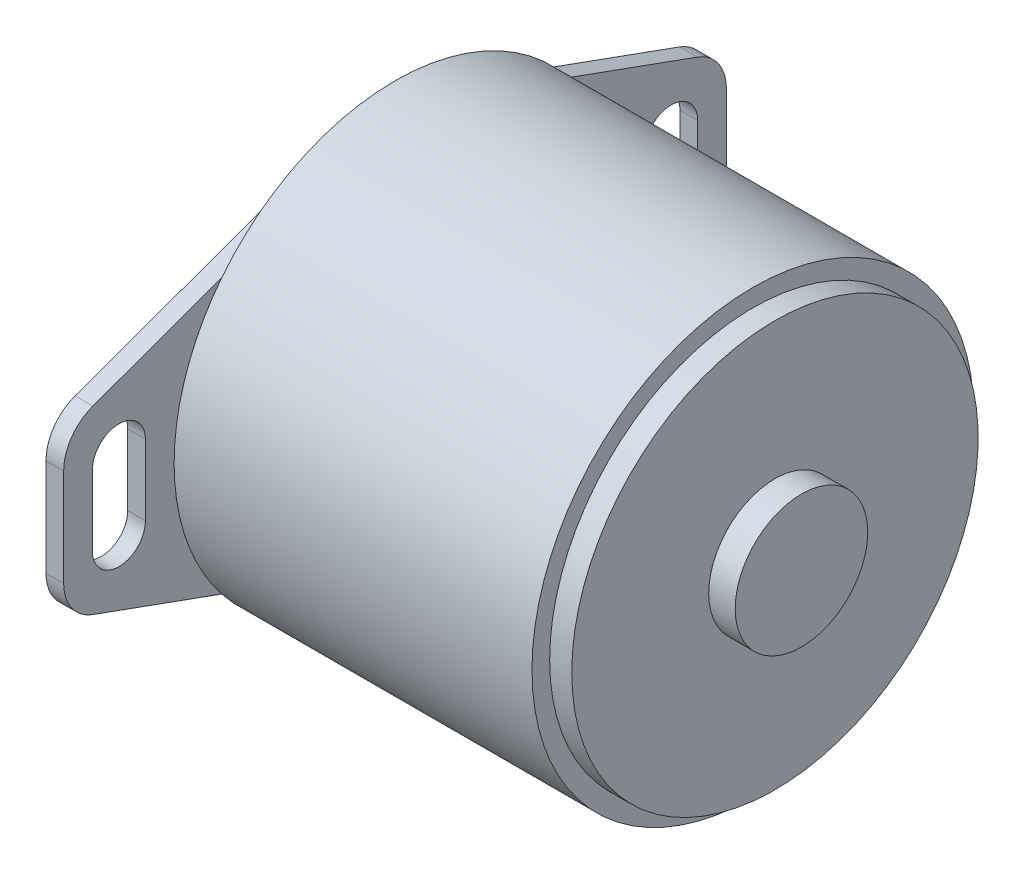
ISO-10303-21;
HEADER;
FILE_DESCRIPTION(('STEP AP214'),'2;1');
FILE_NAME('part.step','',(''),(''),'','','');
FILE_SCHEMA(('AUTOMOTIVE_DESIGN { 1 0 10303 214 1 1 1 1 }'));
ENDSEC;
DATA;
#1=APPLICATION_CONTEXT('core data for automotive mechanical design processes');
#2=APPLICATION_PROTOCOL_DEFINITION('international standard','automotive_design',2000,#1);
#3=PRODUCT_CONTEXT('',#1,'mechanical');
#4=PRODUCT('Part','Part','',(#3));
#5=PRODUCT_RELATED_PRODUCT_CATEGORY('part','',(#4));
#6=PRODUCT_DEFINITION_FORMATION('','',#4);
#7=PRODUCT_DEFINITION_CONTEXT('part definition',#1,'design');
#8=PRODUCT_DEFINITION('design','',#6,#7);
#9=PRODUCT_DEFINITION_SHAPE('','',#8);
#10=(LENGTH_UNIT() NAMED_UNIT(*) SI_UNIT(.MILLI.,.METRE.));
#11=(NAMED_UNIT(*) PLANE_ANGLE_UNIT() SI_UNIT($,.RADIAN.));
#12=(NAMED_UNIT(*) SI_UNIT($,.STERADIAN.) SOLID_ANGLE_UNIT());
#13=UNCERTAINTY_MEASURE_WITH_UNIT(LENGTH_MEASURE(1.E-05),#10,'distance_accuracy_value','');
#14=(GEOMETRIC_REPRESENTATION_CONTEXT(3) GLOBAL_UNCERTAINTY_ASSIGNED_CONTEXT((#13)) GLOBAL_UNIT_ASSIGNED_CONTEXT((#10,
#11,#12)) REPRESENTATION_CONTEXT('',''));
#15=CARTESIAN_POINT('',(0.,0.,0.));
#16=DIRECTION('',(0.,0.,1.));
#17=DIRECTION('',(1.,0.,0.));
#18=AXIS2_PLACEMENT_3D('',#15,#16,#17);
#19=CARTESIAN_POINT('',(6.2,3.,0.));
#20=DIRECTION('',(1.,0.,0.));
#21=DIRECTION('',(0.,0.,-1.));
#22=AXIS2_PLACEMENT_3D('',#19,#20,#21);
#23=PLANE('',#22);
#24=DIRECTION('',(0.,-0.340329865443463,0.940306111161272));
#25=VECTOR('',#24,1.);
#26=CARTESIAN_POINT('',(6.2,-4.08809734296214,-13.6806597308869));
#27=LINE('',#26,#25);
#28=CARTESIAN_POINT('',(6.2,-6.19980313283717,-7.84617366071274));
#29=VERTEX_POINT('',#28);
#30=CARTESIAN_POINT('',(6.2,-7.99260194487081,-2.89280385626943));
#31=VERTEX_POINT('',#30);
#32=EDGE_CURVE('E296',#29,#31,#27,.T.);
#33=ORIENTED_EDGE('',*,*,#32,.F.);
#34=CARTESIAN_POINT('',(6.2,0.,0.));
#35=DIRECTION('',(-1.,0.,0.));
#36=DIRECTION('',(0.,0.,1.));
#37=AXIS2_PLACEMENT_3D('',#34,#35,#36);
#38=CIRCLE('',#37,10.);
#39=CARTESIAN_POINT('',(6.2,-6.19980313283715,7.84617366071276));
#40=VERTEX_POINT('',#39);
#41=EDGE_CURVE('E543',#29,#40,#38,.T.);
#42=ORIENTED_EDGE('',*,*,#41,.T.);
#43=DIRECTION('',(0.,0.340329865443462,0.940306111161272));
#44=VECTOR('',#43,1.);
#45=CARTESIAN_POINT('',(6.2,-4.08809734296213,13.6806597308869));
#46=LINE('',#45,#44);
#47=CARTESIAN_POINT('',(6.2,-7.9926019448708,2.89280385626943));
#48=VERTEX_POINT('',#47);
#49=EDGE_CURVE('E52',#48,#40,#46,.T.);
#50=ORIENTED_EDGE('',*,*,#49,.F.);
#51=CARTESIAN_POINT('',(6.2,0.,0.));
#52=DIRECTION('',(-1.,0.,0.));
#53=DIRECTION('',(0.,0.,1.));
#54=AXIS2_PLACEMENT_3D('',#51,#52,#53);
#55=CIRCLE('',#54,8.49999999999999);
#56=EDGE_CURVE('E47',#31,#48,#55,.T.);
#57=ORIENTED_EDGE('',*,*,#56,.F.);
#58=EDGE_LOOP('',(#33,#42,#50,#57));
#59=FACE_BOUND('',#58,.T.);
#60=ADVANCED_FACE('F32',(#59),#23,.F.);
#61=DIRECTION('',(0.,-0.340329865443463,-0.940306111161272));
#62=VECTOR('',#61,1.);
#63=CARTESIAN_POINT('',(6.2,7.99260194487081,-2.89280385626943));
#64=LINE('',#63,#62);
#65=CARTESIAN_POINT('',(6.2,7.99260194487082,-2.89280385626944));
#66=VERTEX_POINT('',#65);
#67=CARTESIAN_POINT('',(6.2,6.19980313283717,-7.84617366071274));
#68=VERTEX_POINT('',#67);
#69=EDGE_CURVE('E287',#66,#68,#64,.T.);
#70=ORIENTED_EDGE('',*,*,#69,.F.);
#71=CARTESIAN_POINT('',(6.2,0.,0.));
#72=DIRECTION('',(-1.,0.,0.));
#73=DIRECTION('',(0.,0.,1.));
#74=AXIS2_PLACEMENT_3D('',#71,#72,#73);
#75=CIRCLE('',#74,8.5);
#76=CARTESIAN_POINT('',(6.2,7.99260194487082,2.89280385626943));
#77=VERTEX_POINT('',#76);
#78=EDGE_CURVE('E256',#77,#66,#75,.T.);
#79=ORIENTED_EDGE('',*,*,#78,.F.);
#80=DIRECTION('',(0.,0.340329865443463,-0.940306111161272));
#81=VECTOR('',#80,1.);
#82=CARTESIAN_POINT('',(6.2,7.99260194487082,2.89280385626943));
#83=LINE('',#82,#81);
#84=CARTESIAN_POINT('',(6.2,6.19980313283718,7.84617366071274));
#85=VERTEX_POINT('',#84);
#86=EDGE_CURVE('E309',#85,#77,#83,.T.);
#87=ORIENTED_EDGE('',*,*,#86,.F.);
#88=EDGE_CURVE('E363',#85,#68,#38,.T.);
#89=ORIENTED_EDGE('',*,*,#88,.T.);
#90=EDGE_LOOP('',(#70,#79,#87,#89));
#91=FACE_BOUND('',#90,.T.);
#92=ADVANCED_FACE('F393',(#91),#23,.F.);
#93=CARTESIAN_POINT('',(-32.441525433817,0.,0.));
#94=DIRECTION('',(-1.,0.,0.));
#95=DIRECTION('',(0.,0.,1.));
#96=AXIS2_PLACEMENT_3D('',#93,#94,#95);
#97=CYLINDRICAL_SURFACE('',#96,10.);
#98=ORIENTED_EDGE('',*,*,#88,.F.);
#99=EDGE_CURVE('E362',#40,#85,#38,.T.);
#100=ORIENTED_EDGE('',*,*,#99,.F.);
#101=ORIENTED_EDGE('',*,*,#41,.F.);
#102=EDGE_CURVE('E367',#68,#29,#38,.T.);
#103=ORIENTED_EDGE('',*,*,#102,.F.);
#104=EDGE_LOOP('',(#98,#100,#101,#103));
#105=FACE_BOUND('',#104,.T.);
#106=CARTESIAN_POINT('',(22.4,0.,0.));
#107=DIRECTION('',(-1.,0.,0.));
#108=DIRECTION('',(0.,0.,1.));
#109=AXIS2_PLACEMENT_3D('',#106,#107,#108);
#110=CIRCLE('',#109,10.);
#111=CARTESIAN_POINT('',(22.4,0.,10.));
#112=VERTEX_POINT('',#111);
#113=EDGE_CURVE('E359',#112,#112,#110,.T.);
#114=ORIENTED_EDGE('',*,*,#113,.T.);
#115=EDGE_LOOP('',(#114));
#116=FACE_BOUND('',#115,.T.);
#117=ADVANCED_FACE('F422',(#105,#116),#97,.T.);
#118=CARTESIAN_POINT('',(22.4,10.,0.));
#119=DIRECTION('',(-1.,0.,0.));
#120=DIRECTION('',(0.,0.,1.));
#121=AXIS2_PLACEMENT_3D('',#118,#119,#120);
#122=PLANE('',#121);
#123=ORIENTED_EDGE('',*,*,#113,.F.);
#124=EDGE_LOOP('',(#123));
#125=FACE_BOUND('',#124,.T.);
#126=CARTESIAN_POINT('',(22.4,0.,0.));
#127=DIRECTION('',(-1.,0.,0.));
#128=DIRECTION('',(0.,0.,1.));
#129=AXIS2_PLACEMENT_3D('',#126,#127,#128);
#130=CIRCLE('',#129,9.2);
#131=CARTESIAN_POINT('',(22.4,0.,9.2));
#132=VERTEX_POINT('',#131);
#133=EDGE_CURVE('E356',#132,#132,#130,.T.);
#134=ORIENTED_EDGE('',*,*,#133,.T.);
#135=EDGE_LOOP('',(#134));
#136=FACE_BOUND('',#135,.T.);
#137=ADVANCED_FACE('F547',(#125,#136),#122,.F.);
#138=CARTESIAN_POINT('',(-32.441525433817,0.,0.));
#139=DIRECTION('',(-1.,0.,0.));
#140=DIRECTION('',(0.,0.,1.));
#141=AXIS2_PLACEMENT_3D('',#138,#139,#140);
#142=CYLINDRICAL_SURFACE('',#141,9.2);
#143=ORIENTED_EDGE('',*,*,#133,.F.);
#144=EDGE_LOOP('',(#143));
#145=FACE_BOUND('',#144,.T.);
#146=CARTESIAN_POINT('',(23.4,0.,0.));
#147=DIRECTION('',(-1.,0.,0.));
#148=DIRECTION('',(0.,0.,1.));
#149=AXIS2_PLACEMENT_3D('',#146,#147,#148);
#150=CIRCLE('',#149,9.2);
#151=CARTESIAN_POINT('',(23.4,0.,9.2));
#152=VERTEX_POINT('',#151);
#153=EDGE_CURVE('E353',#152,#152,#150,.T.);
#154=ORIENTED_EDGE('',*,*,#153,.T.);
#155=EDGE_LOOP('',(#154));
#156=FACE_BOUND('',#155,.T.);
#157=ADVANCED_FACE('F552',(#145,#156),#142,.T.);
#158=CARTESIAN_POINT('',(23.4,9.2,0.));
#159=DIRECTION('',(-1.,0.,0.));
#160=DIRECTION('',(0.,0.,1.));
#161=AXIS2_PLACEMENT_3D('',#158,#159,#160);
#162=PLANE('',#161);
#163=ORIENTED_EDGE('',*,*,#153,.F.);
#164=EDGE_LOOP('',(#163));
#165=FACE_BOUND('',#164,.T.);
#166=CARTESIAN_POINT('',(23.4,0.,0.));
#167=DIRECTION('',(-1.,0.,0.));
#168=DIRECTION('',(0.,0.,1.));
#169=AXIS2_PLACEMENT_3D('',#166,#167,#168);
#170=CIRCLE('',#169,3.);
#171=CARTESIAN_POINT('',(23.4,0.,3.));
#172=VERTEX_POINT('',#171);
#173=EDGE_CURVE('E350',#172,#172,#170,.T.);
#174=ORIENTED_EDGE('',*,*,#173,.T.);
#175=EDGE_LOOP('',(#174));
#176=FACE_BOUND('',#175,.T.);
#177=ADVANCED_FACE('F557',(#165,#176),#162,.F.);
#178=CARTESIAN_POINT('',(-32.441525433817,0.,0.));
#179=DIRECTION('',(-1.,0.,0.));
#180=DIRECTION('',(0.,0.,1.));
#181=AXIS2_PLACEMENT_3D('',#178,#179,#180);
#182=CYLINDRICAL_SURFACE('',#181,3.);
#183=ORIENTED_EDGE('',*,*,#173,.F.);
#184=EDGE_LOOP('',(#183));
#185=FACE_BOUND('',#184,.T.);
#186=CARTESIAN_POINT('',(24.6,0.,0.));
#187=DIRECTION('',(-1.,0.,0.));
#188=DIRECTION('',(0.,0.,1.));
#189=AXIS2_PLACEMENT_3D('',#186,#187,#188);
#190=CIRCLE('',#189,3.);
#191=CARTESIAN_POINT('',(24.6,0.,3.));
#192=VERTEX_POINT('',#191);
#193=EDGE_CURVE('E347',#192,#192,#190,.T.);
#194=ORIENTED_EDGE('',*,*,#193,.T.);
#195=EDGE_LOOP('',(#194));
#196=FACE_BOUND('',#195,.T.);
#197=ADVANCED_FACE('F563',(#185,#196),#182,.T.);
#198=CARTESIAN_POINT('',(24.6,3.,0.));
#199=DIRECTION('',(-1.,0.,0.));
#200=DIRECTION('',(0.,0.,1.));
#201=AXIS2_PLACEMENT_3D('',#198,#199,#200);
#202=PLANE('',#201);
#203=ORIENTED_EDGE('',*,*,#193,.F.);
#204=EDGE_LOOP('',(#203));
#205=FACE_BOUND('',#204,.T.);
#206=ADVANCED_FACE('F415',(#205),#202,.F.);
#207=CARTESIAN_POINT('',(6.2,0.,0.));
#208=DIRECTION('',(-1.,0.,0.));
#209=DIRECTION('',(0.,0.,1.));
#210=AXIS2_PLACEMENT_3D('',#207,#208,#209);
#211=PLANE('',#210);
#212=CARTESIAN_POINT('',(6.2,1.6,-12.5));
#213=DIRECTION('',(-1.,0.,0.));
#214=DIRECTION('',(0.,0.,1.));
#215=AXIS2_PLACEMENT_3D('',#212,#213,#214);
#216=CIRCLE('',#215,1.2);
#217=CARTESIAN_POINT('',(6.2,1.6,-11.3));
#218=VERTEX_POINT('',#217);
#219=CARTESIAN_POINT('',(6.2,1.6,-13.7));
#220=VERTEX_POINT('',#219);
#221=EDGE_CURVE('E199',#218,#220,#216,.T.);
#222=ORIENTED_EDGE('',*,*,#221,.T.);
#223=DIRECTION('',(0.,-1.,0.));
#224=VECTOR('',#223,1.);
#225=CARTESIAN_POINT('',(6.2,1.6,-13.7));
#226=LINE('',#225,#224);
#227=CARTESIAN_POINT('',(6.2,-1.6,-13.7));
#228=VERTEX_POINT('',#227);
#229=EDGE_CURVE('E239',#220,#228,#226,.T.);
#230=ORIENTED_EDGE('',*,*,#229,.T.);
#231=CARTESIAN_POINT('',(6.2,-1.6,-12.5));
#232=DIRECTION('',(-1.,0.,0.));
#233=DIRECTION('',(0.,0.,1.));
#234=AXIS2_PLACEMENT_3D('',#231,#232,#233);
#235=CIRCLE('',#234,1.2);
#236=CARTESIAN_POINT('',(6.2,-1.6,-11.3));
#237=VERTEX_POINT('',#236);
#238=EDGE_CURVE('E242',#228,#237,#235,.T.);
#239=ORIENTED_EDGE('',*,*,#238,.T.);
#240=DIRECTION('',(0.,1.,0.));
#241=VECTOR('',#240,1.);
#242=CARTESIAN_POINT('',(6.2,1.6,-11.3));
#243=LINE('',#242,#241);
#244=EDGE_CURVE('E229',#237,#218,#243,.T.);
#245=ORIENTED_EDGE('',*,*,#244,.T.);
#246=EDGE_LOOP('',(#222,#230,#239,#245));
#247=FACE_BOUND('',#246,.T.);
#248=CARTESIAN_POINT('',(6.2,4.08809734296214,-13.6806597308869));
#249=VERTEX_POINT('',#248);
#250=EDGE_CURVE('E286',#68,#249,#64,.T.);
#251=ORIENTED_EDGE('',*,*,#250,.F.);
#252=ORIENTED_EDGE('',*,*,#102,.T.);
#253=CARTESIAN_POINT('',(6.2,-4.08809734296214,-13.6806597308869));
#254=VERTEX_POINT('',#253);
#255=EDGE_CURVE('E297',#254,#29,#27,.T.);
#256=ORIENTED_EDGE('',*,*,#255,.F.);
#257=CARTESIAN_POINT('',(6.2,-2.20748512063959,-13.));
#258=DIRECTION('',(-1.,0.,0.));
#259=DIRECTION('',(0.,0.,-1.));
#260=AXIS2_PLACEMENT_3D('',#257,#258,#259);
#261=CIRCLE('',#260,2.);
#262=CARTESIAN_POINT('',(6.2,-2.20748512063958,-15.));
#263=VERTEX_POINT('',#262);
#264=EDGE_CURVE('E294',#263,#254,#261,.T.);
#265=ORIENTED_EDGE('',*,*,#264,.F.);
#266=DIRECTION('',(0.,-1.,0.));
#267=VECTOR('',#266,1.);
#268=CARTESIAN_POINT('',(6.2,2.20748512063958,-15.));
#269=LINE('',#268,#267);
#270=CARTESIAN_POINT('',(6.2,2.20748512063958,-15.));
#271=VERTEX_POINT('',#270);
#272=EDGE_CURVE('E292',#271,#263,#269,.T.);
#273=ORIENTED_EDGE('',*,*,#272,.F.);
#274=CARTESIAN_POINT('',(6.2,2.20748512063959,-13.));
#275=DIRECTION('',(-1.,0.,0.));
#276=DIRECTION('',(0.,0.,1.));
#277=AXIS2_PLACEMENT_3D('',#274,#275,#276);
#278=CIRCLE('',#277,2.);
#279=EDGE_CURVE('E290',#249,#271,#278,.T.);
#280=ORIENTED_EDGE('',*,*,#279,.F.);
#281=EDGE_LOOP('',(#251,#252,#256,#265,#273,#280));
#282=FACE_BOUND('',#281,.T.);
#283=ADVANCED_FACE('F406',(#247,#282),#211,.F.);
#284=CARTESIAN_POINT('',(5.4,0.,0.));
#285=DIRECTION('',(-1.,0.,0.));
#286=DIRECTION('',(0.,0.,1.));
#287=AXIS2_PLACEMENT_3D('',#284,#285,#286);
#288=PLANE('',#287);
#289=DIRECTION('',(0.,-1.,0.));
#290=VECTOR('',#289,1.);
#291=CARTESIAN_POINT('',(5.4,1.60000000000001,11.3));
#292=LINE('',#291,#290);
#293=CARTESIAN_POINT('',(5.4,1.60000000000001,11.3));
#294=VERTEX_POINT('',#293);
#295=CARTESIAN_POINT('',(5.4,-1.59999999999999,11.3));
#296=VERTEX_POINT('',#295);
#297=EDGE_CURVE('E191',#294,#296,#292,.T.);
#298=ORIENTED_EDGE('',*,*,#297,.F.);
#299=CARTESIAN_POINT('',(5.4,1.60000000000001,12.5));
#300=DIRECTION('',(-1.,0.,0.));
#301=DIRECTION('',(0.,0.,-1.));
#302=AXIS2_PLACEMENT_3D('',#299,#300,#301);
#303=CIRCLE('',#302,1.2);
#304=CARTESIAN_POINT('',(5.4,1.60000000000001,13.7));
#305=VERTEX_POINT('',#304);
#306=EDGE_CURVE('E181',#305,#294,#303,.T.);
#307=ORIENTED_EDGE('',*,*,#306,.F.);
#308=DIRECTION('',(0.,1.,0.));
#309=VECTOR('',#308,1.);
#310=CARTESIAN_POINT('',(5.4,1.60000000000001,13.7));
#311=LINE('',#310,#309);
#312=CARTESIAN_POINT('',(5.4,-1.59999999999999,13.7));
#313=VERTEX_POINT('',#312);
#314=EDGE_CURVE('E208',#313,#305,#311,.T.);
#315=ORIENTED_EDGE('',*,*,#314,.F.);
#316=CARTESIAN_POINT('',(5.4,-1.59999999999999,12.5));
#317=DIRECTION('',(-1.,0.,0.));
#318=DIRECTION('',(0.,0.,-1.));
#319=AXIS2_PLACEMENT_3D('',#316,#317,#318);
#320=CIRCLE('',#319,1.2);
#321=EDGE_CURVE('E206',#296,#313,#320,.T.);
#322=ORIENTED_EDGE('',*,*,#321,.F.);
#323=EDGE_LOOP('',(#298,#307,#315,#322));
#324=FACE_BOUND('',#323,.T.);
#325=DIRECTION('',(0.,-1.,0.));
#326=VECTOR('',#325,1.);
#327=CARTESIAN_POINT('',(5.4,1.6,-13.7));
#328=LINE('',#327,#326);
#329=CARTESIAN_POINT('',(5.4,1.6,-13.7));
#330=VERTEX_POINT('',#329);
#331=CARTESIAN_POINT('',(5.4,-1.6,-13.7));
#332=VERTEX_POINT('',#331);
#333=EDGE_CURVE('E228',#330,#332,#328,.T.);
#334=ORIENTED_EDGE('',*,*,#333,.F.);
#335=CARTESIAN_POINT('',(5.4,1.6,-12.5));
#336=DIRECTION('',(-1.,0.,0.));
#337=DIRECTION('',(0.,0.,1.));
#338=AXIS2_PLACEMENT_3D('',#335,#336,#337);
#339=CIRCLE('',#338,1.2);
#340=CARTESIAN_POINT('',(5.4,1.6,-11.3));
#341=VERTEX_POINT('',#340);
#342=EDGE_CURVE('E226',#341,#330,#339,.T.);
#343=ORIENTED_EDGE('',*,*,#342,.F.);
#344=DIRECTION('',(0.,1.,0.));
#345=VECTOR('',#344,1.);
#346=CARTESIAN_POINT('',(5.4,1.6,-11.3));
#347=LINE('',#346,#345);
#348=CARTESIAN_POINT('',(5.4,-1.6,-11.3));
#349=VERTEX_POINT('',#348);
#350=EDGE_CURVE('E234',#349,#341,#347,.T.);
#351=ORIENTED_EDGE('',*,*,#350,.F.);
#352=CARTESIAN_POINT('',(5.4,-1.6,-12.5));
#353=DIRECTION('',(-1.,0.,0.));
#354=DIRECTION('',(0.,0.,1.));
#355=AXIS2_PLACEMENT_3D('',#352,#353,#354);
#356=CIRCLE('',#355,1.2);
#357=EDGE_CURVE('E231',#332,#349,#356,.T.);
#358=ORIENTED_EDGE('',*,*,#357,.F.);
#359=EDGE_LOOP('',(#334,#343,#351,#358));
#360=FACE_BOUND('',#359,.T.);
#361=CARTESIAN_POINT('',(5.4,0.,0.));
#362=DIRECTION('',(-1.,0.,0.));
#363=DIRECTION('',(0.,0.,1.));
#364=AXIS2_PLACEMENT_3D('',#361,#362,#363);
#365=CIRCLE('',#364,8.5);
#366=CARTESIAN_POINT('',(5.4,7.99260194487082,2.89280385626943));
#367=VERTEX_POINT('',#366);
#368=CARTESIAN_POINT('',(5.4,7.99260194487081,-2.89280385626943));
#369=VERTEX_POINT('',#368);
#370=EDGE_CURVE('E257',#367,#369,#365,.T.);
#371=ORIENTED_EDGE('',*,*,#370,.T.);
#372=DIRECTION('',(0.,-0.340329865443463,-0.940306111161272));
#373=VECTOR('',#372,1.);
#374=CARTESIAN_POINT('',(5.4,7.99260194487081,-2.89280385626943));
#375=LINE('',#374,#373);
#376=CARTESIAN_POINT('',(5.4,4.08809734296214,-13.6806597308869));
#377=VERTEX_POINT('',#376);
#378=EDGE_CURVE('E260',#369,#377,#375,.T.);
#379=ORIENTED_EDGE('',*,*,#378,.T.);
#380=CARTESIAN_POINT('',(5.4,2.20748512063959,-13.));
#381=DIRECTION('',(-1.,0.,0.));
#382=DIRECTION('',(0.,0.,1.));
#383=AXIS2_PLACEMENT_3D('',#380,#381,#382);
#384=CIRCLE('',#383,2.);
#385=CARTESIAN_POINT('',(5.4,2.20748512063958,-15.));
#386=VERTEX_POINT('',#385);
#387=EDGE_CURVE('E263',#377,#386,#384,.T.);
#388=ORIENTED_EDGE('',*,*,#387,.T.);
#389=DIRECTION('',(0.,-1.,0.));
#390=VECTOR('',#389,1.);
#391=CARTESIAN_POINT('',(5.4,2.20748512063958,-15.));
#392=LINE('',#391,#390);
#393=CARTESIAN_POINT('',(5.4,-2.20748512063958,-15.));
#394=VERTEX_POINT('',#393);
#395=EDGE_CURVE('E265',#386,#394,#392,.T.);
#396=ORIENTED_EDGE('',*,*,#395,.T.);
#397=CARTESIAN_POINT('',(5.4,-2.20748512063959,-13.));
#398=DIRECTION('',(-1.,0.,0.));
#399=DIRECTION('',(0.,0.,-1.));
#400=AXIS2_PLACEMENT_3D('',#397,#398,#399);
#401=CIRCLE('',#400,2.);
#402=CARTESIAN_POINT('',(5.4,-4.08809734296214,-13.6806597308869));
#403=VERTEX_POINT('',#402);
#404=EDGE_CURVE('E267',#394,#403,#401,.T.);
#405=ORIENTED_EDGE('',*,*,#404,.T.);
#406=DIRECTION('',(0.,-0.340329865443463,0.940306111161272));
#407=VECTOR('',#406,1.);
#408=CARTESIAN_POINT('',(5.4,-4.08809734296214,-13.6806597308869));
#409=LINE('',#408,#407);
#410=CARTESIAN_POINT('',(5.4,-7.99260194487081,-2.89280385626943));
#411=VERTEX_POINT('',#410);
#412=EDGE_CURVE('E269',#403,#411,#409,.T.);
#413=ORIENTED_EDGE('',*,*,#412,.T.);
#414=CARTESIAN_POINT('',(5.4,0.,0.));
#415=DIRECTION('',(-1.,0.,0.));
#416=DIRECTION('',(0.,0.,1.));
#417=AXIS2_PLACEMENT_3D('',#414,#415,#416);
#418=CIRCLE('',#417,8.49999999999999);
#419=CARTESIAN_POINT('',(5.4,-7.99260194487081,2.89280385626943));
#420=VERTEX_POINT('',#419);
#421=EDGE_CURVE('E271',#411,#420,#418,.T.);
#422=ORIENTED_EDGE('',*,*,#421,.T.);
#423=DIRECTION('',(0.,0.340329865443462,0.940306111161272));
#424=VECTOR('',#423,1.);
#425=CARTESIAN_POINT('',(5.4,-4.08809734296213,13.6806597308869));
#426=LINE('',#425,#424);
#427=CARTESIAN_POINT('',(5.4,-4.08809734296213,13.6806597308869));
#428=VERTEX_POINT('',#427);
#429=EDGE_CURVE('E273',#420,#428,#426,.T.);
#430=ORIENTED_EDGE('',*,*,#429,.T.);
#431=CARTESIAN_POINT('',(5.4,-2.20748512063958,13.));
#432=DIRECTION('',(-1.,0.,0.));
#433=DIRECTION('',(0.,0.,-1.));
#434=AXIS2_PLACEMENT_3D('',#431,#432,#433);
#435=CIRCLE('',#434,2.);
#436=CARTESIAN_POINT('',(5.4,-2.20748512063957,15.));
#437=VERTEX_POINT('',#436);
#438=EDGE_CURVE('E275',#428,#437,#435,.T.);
#439=ORIENTED_EDGE('',*,*,#438,.T.);
#440=DIRECTION('',(0.,1.,0.));
#441=VECTOR('',#440,1.);
#442=CARTESIAN_POINT('',(5.4,2.20748512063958,15.));
#443=LINE('',#442,#441);
#444=CARTESIAN_POINT('',(5.4,2.20748512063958,15.));
#445=VERTEX_POINT('',#444);
#446=EDGE_CURVE('E277',#437,#445,#443,.T.);
#447=ORIENTED_EDGE('',*,*,#446,.T.);
#448=CARTESIAN_POINT('',(5.4,2.20748512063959,13.));
#449=DIRECTION('',(-1.,0.,0.));
#450=DIRECTION('',(0.,0.,-1.));
#451=AXIS2_PLACEMENT_3D('',#448,#449,#450);
#452=CIRCLE('',#451,2.);
#453=CARTESIAN_POINT('',(5.4,4.08809734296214,13.6806597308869));
#454=VERTEX_POINT('',#453);
#455=EDGE_CURVE('E279',#445,#454,#452,.T.);
#456=ORIENTED_EDGE('',*,*,#455,.T.);
#457=DIRECTION('',(0.,0.340329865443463,-0.940306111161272));
#458=VECTOR('',#457,1.);
#459=CARTESIAN_POINT('',(5.4,7.99260194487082,2.89280385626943));
#460=LINE('',#459,#458);
#461=EDGE_CURVE('E281',#454,#367,#460,.T.);
#462=ORIENTED_EDGE('',*,*,#461,.T.);
#463=EDGE_LOOP('',(#371,#379,#388,#396,#405,#413,#422,#430,#439,#447,#456,#462));
#464=FACE_BOUND('',#463,.T.);
#465=CARTESIAN_POINT('',(5.4,0.,0.));
#466=DIRECTION('',(-1.,0.,0.));
#467=DIRECTION('',(0.,0.,1.));
#468=AXIS2_PLACEMENT_3D('',#465,#466,#467);
#469=CIRCLE('',#468,4.12883072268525);
#470=CARTESIAN_POINT('',(5.4,0.,4.12883072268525));
#471=VERTEX_POINT('',#470);
#472=EDGE_CURVE('E215',#471,#471,#469,.T.);
#473=ORIENTED_EDGE('',*,*,#472,.F.);
#474=EDGE_LOOP('',(#473));
#475=FACE_BOUND('',#474,.T.);
#476=ADVANCED_FACE('F203',(#324,#360,#464,#475),#288,.T.);
#477=CARTESIAN_POINT('',(6.2,-4.08809734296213,13.6806597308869));
#478=VERTEX_POINT('',#477);
#479=EDGE_CURVE('E301',#40,#478,#46,.T.);
#480=ORIENTED_EDGE('',*,*,#479,.F.);
#481=ORIENTED_EDGE('',*,*,#99,.T.);
#482=CARTESIAN_POINT('',(6.2,4.08809734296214,13.6806597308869));
#483=VERTEX_POINT('',#482);
#484=EDGE_CURVE('E261',#483,#85,#83,.T.);
#485=ORIENTED_EDGE('',*,*,#484,.F.);
#486=CARTESIAN_POINT('',(6.2,2.20748512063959,13.));
#487=DIRECTION('',(-1.,0.,0.));
#488=DIRECTION('',(0.,0.,-1.));
#489=AXIS2_PLACEMENT_3D('',#486,#487,#488);
#490=CIRCLE('',#489,2.);
#491=CARTESIAN_POINT('',(6.2,2.20748512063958,15.));
#492=VERTEX_POINT('',#491);
#493=EDGE_CURVE('E307',#492,#483,#490,.T.);
#494=ORIENTED_EDGE('',*,*,#493,.F.);
#495=DIRECTION('',(0.,1.,0.));
#496=VECTOR('',#495,1.);
#497=CARTESIAN_POINT('',(6.2,2.20748512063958,15.));
#498=LINE('',#497,#496);
#499=CARTESIAN_POINT('',(6.2,-2.20748512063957,15.));
#500=VERTEX_POINT('',#499);
#501=EDGE_CURVE('E305',#500,#492,#498,.T.);
#502=ORIENTED_EDGE('',*,*,#501,.F.);
#503=CARTESIAN_POINT('',(6.2,-2.20748512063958,13.));
#504=DIRECTION('',(-1.,0.,0.));
#505=DIRECTION('',(0.,0.,-1.));
#506=AXIS2_PLACEMENT_3D('',#503,#504,#505);
#507=CIRCLE('',#506,2.);
#508=EDGE_CURVE('E303',#478,#500,#507,.T.);
#509=ORIENTED_EDGE('',*,*,#508,.F.);
#510=EDGE_LOOP('',(#480,#481,#485,#494,#502,#509));
#511=FACE_BOUND('',#510,.T.);
#512=CARTESIAN_POINT('',(6.2,1.60000000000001,12.5));
#513=DIRECTION('',(-1.,0.,0.));
#514=DIRECTION('',(0.,0.,-1.));
#515=AXIS2_PLACEMENT_3D('',#512,#513,#514);
#516=CIRCLE('',#515,1.2);
#517=CARTESIAN_POINT('',(6.2,1.60000000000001,13.7));
#518=VERTEX_POINT('',#517);
#519=CARTESIAN_POINT('',(6.2,1.60000000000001,11.3));
#520=VERTEX_POINT('',#519);
#521=EDGE_CURVE('E213',#518,#520,#516,.T.);
#522=ORIENTED_EDGE('',*,*,#521,.T.);
#523=DIRECTION('',(0.,-1.,0.));
#524=VECTOR('',#523,1.);
#525=CARTESIAN_POINT('',(6.2,1.60000000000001,11.3));
#526=LINE('',#525,#524);
#527=CARTESIAN_POINT('',(6.2,-1.59999999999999,11.3));
#528=VERTEX_POINT('',#527);
#529=EDGE_CURVE('E198',#520,#528,#526,.T.);
#530=ORIENTED_EDGE('',*,*,#529,.T.);
#531=CARTESIAN_POINT('',(6.2,-1.59999999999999,12.5));
#532=DIRECTION('',(-1.,0.,0.));
#533=DIRECTION('',(0.,0.,-1.));
#534=AXIS2_PLACEMENT_3D('',#531,#532,#533);
#535=CIRCLE('',#534,1.2);
#536=CARTESIAN_POINT('',(6.2,-1.59999999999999,13.7));
#537=VERTEX_POINT('',#536);
#538=EDGE_CURVE('E217',#528,#537,#535,.T.);
#539=ORIENTED_EDGE('',*,*,#538,.T.);
#540=DIRECTION('',(0.,1.,0.));
#541=VECTOR('',#540,1.);
#542=CARTESIAN_POINT('',(6.2,1.60000000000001,13.7));
#543=LINE('',#542,#541);
#544=EDGE_CURVE('E192',#537,#518,#543,.T.);
#545=ORIENTED_EDGE('',*,*,#544,.T.);
#546=EDGE_LOOP('',(#522,#530,#539,#545));
#547=FACE_BOUND('',#546,.T.);
#548=ADVANCED_FACE('F405',(#511,#547),#211,.F.);
#549=CARTESIAN_POINT('',(5.4,0.,0.));
#550=DIRECTION('',(1.,0.,0.));
#551=DIRECTION('',(0.,0.,-1.));
#552=AXIS2_PLACEMENT_3D('',#549,#550,#551);
#553=CYLINDRICAL_SURFACE('',#552,8.5);
#554=ORIENTED_EDGE('',*,*,#78,.T.);
#555=DIRECTION('',(1.,0.,0.));
#556=VECTOR('',#555,1.);
#557=CARTESIAN_POINT('',(5.4,7.99260194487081,-2.89280385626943));
#558=LINE('',#557,#556);
#559=EDGE_CURVE('E344',#369,#66,#558,.T.);
#560=ORIENTED_EDGE('',*,*,#559,.F.);
#561=ORIENTED_EDGE('',*,*,#370,.F.);
#562=DIRECTION('',(1.,0.,0.));
#563=VECTOR('',#562,1.);
#564=CARTESIAN_POINT('',(5.4,7.99260194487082,2.89280385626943));
#565=LINE('',#564,#563);
#566=EDGE_CURVE('E283',#367,#77,#565,.T.);
#567=ORIENTED_EDGE('',*,*,#566,.T.);
#568=EDGE_LOOP('',(#554,#560,#561,#567));
#569=FACE_BOUND('',#568,.T.);
#570=ADVANCED_FACE('F412',(#569),#553,.T.);
#571=CARTESIAN_POINT('',(5.4,7.99260194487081,-2.89280385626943));
#572=DIRECTION('',(0.,-0.940306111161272,0.340329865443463));
#573=DIRECTION('',(0.,-0.340329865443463,-0.940306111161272));
#574=AXIS2_PLACEMENT_3D('',#571,#572,#573);
#575=PLANE('',#574);
#576=ORIENTED_EDGE('',*,*,#69,.T.);
#577=ORIENTED_EDGE('',*,*,#250,.T.);
#578=DIRECTION('',(1.,0.,0.));
#579=VECTOR('',#578,1.);
#580=CARTESIAN_POINT('',(5.4,4.08809734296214,-13.6806597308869));
#581=LINE('',#580,#579);
#582=EDGE_CURVE('E341',#377,#249,#581,.T.);
#583=ORIENTED_EDGE('',*,*,#582,.F.);
#584=ORIENTED_EDGE('',*,*,#378,.F.);
#585=ORIENTED_EDGE('',*,*,#559,.T.);
#586=EDGE_LOOP('',(#576,#577,#583,#584,#585));
#587=FACE_BOUND('',#586,.T.);
#588=ADVANCED_FACE('F491',(#587),#575,.F.);
#589=CARTESIAN_POINT('',(5.4,2.20748512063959,-13.));
#590=DIRECTION('',(1.,0.,0.));
#591=DIRECTION('',(0.,0.,-1.));
#592=AXIS2_PLACEMENT_3D('',#589,#590,#591);
#593=CYLINDRICAL_SURFACE('',#592,2.);
#594=ORIENTED_EDGE('',*,*,#279,.T.);
#595=DIRECTION('',(1.,0.,0.));
#596=VECTOR('',#595,1.);
#597=CARTESIAN_POINT('',(5.4,2.20748512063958,-15.));
#598=LINE('',#597,#596);
#599=EDGE_CURVE('E338',#386,#271,#598,.T.);
#600=ORIENTED_EDGE('',*,*,#599,.F.);
#601=ORIENTED_EDGE('',*,*,#387,.F.);
#602=ORIENTED_EDGE('',*,*,#582,.T.);
#603=EDGE_LOOP('',(#594,#600,#601,#602));
#604=FACE_BOUND('',#603,.T.);
#605=ADVANCED_FACE('F497',(#604),#593,.T.);
#606=CARTESIAN_POINT('',(5.4,2.20748512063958,-15.));
#607=DIRECTION('',(0.,0.,1.));
#608=DIRECTION('',(1.,0.,0.));
#609=AXIS2_PLACEMENT_3D('',#606,#607,#608);
#610=PLANE('',#609);
#611=ORIENTED_EDGE('',*,*,#272,.T.);
#612=DIRECTION('',(1.,0.,0.));
#613=VECTOR('',#612,1.);
#614=CARTESIAN_POINT('',(5.4,-2.20748512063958,-15.));
#615=LINE('',#614,#613);
#616=EDGE_CURVE('E335',#394,#263,#615,.T.);
#617=ORIENTED_EDGE('',*,*,#616,.F.);
#618=ORIENTED_EDGE('',*,*,#395,.F.);
#619=ORIENTED_EDGE('',*,*,#599,.T.);
#620=EDGE_LOOP('',(#611,#617,#618,#619));
#621=FACE_BOUND('',#620,.T.);
#622=ADVANCED_FACE('F503',(#621),#610,.F.);
#623=CARTESIAN_POINT('',(5.4,-2.20748512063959,-13.));
#624=DIRECTION('',(1.,0.,0.));
#625=DIRECTION('',(0.,0.,-1.));
#626=AXIS2_PLACEMENT_3D('',#623,#624,#625);
#627=CYLINDRICAL_SURFACE('',#626,2.);
#628=ORIENTED_EDGE('',*,*,#264,.T.);
#629=DIRECTION('',(1.,0.,0.));
#630=VECTOR('',#629,1.);
#631=CARTESIAN_POINT('',(5.4,-4.08809734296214,-13.6806597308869));
#632=LINE('',#631,#630);
#633=EDGE_CURVE('E332',#403,#254,#632,.T.);
#634=ORIENTED_EDGE('',*,*,#633,.F.);
#635=ORIENTED_EDGE('',*,*,#404,.F.);
#636=ORIENTED_EDGE('',*,*,#616,.T.);
#637=EDGE_LOOP('',(#628,#634,#635,#636));
#638=FACE_BOUND('',#637,.T.);
#639=ADVANCED_FACE('F507',(#638),#627,.T.);
#640=CARTESIAN_POINT('',(5.4,-4.08809734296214,-13.6806597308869));
#641=DIRECTION('',(0.,0.940306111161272,0.340329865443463));
#642=DIRECTION('',(0.,-0.340329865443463,0.940306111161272));
#643=AXIS2_PLACEMENT_3D('',#640,#641,#642);
#644=PLANE('',#643);
#645=ORIENTED_EDGE('',*,*,#255,.T.);
#646=ORIENTED_EDGE('',*,*,#32,.T.);
#647=DIRECTION('',(1.,0.,0.));
#648=VECTOR('',#647,1.);
#649=CARTESIAN_POINT('',(5.4,-7.99260194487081,-2.89280385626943));
#650=LINE('',#649,#648);
#651=EDGE_CURVE('E329',#411,#31,#650,.T.);
#652=ORIENTED_EDGE('',*,*,#651,.F.);
#653=ORIENTED_EDGE('',*,*,#412,.F.);
#654=ORIENTED_EDGE('',*,*,#633,.T.);
#655=EDGE_LOOP('',(#645,#646,#652,#653,#654));
#656=FACE_BOUND('',#655,.T.);
#657=ADVANCED_FACE('F512',(#656),#644,.F.);
#658=CARTESIAN_POINT('',(5.4,0.,0.));
#659=DIRECTION('',(1.,0.,0.));
#660=DIRECTION('',(0.,0.,-1.));
#661=AXIS2_PLACEMENT_3D('',#658,#659,#660);
#662=CYLINDRICAL_SURFACE('',#661,8.49999999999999);
#663=ORIENTED_EDGE('',*,*,#56,.T.);
#664=DIRECTION('',(1.,0.,0.));
#665=VECTOR('',#664,1.);
#666=CARTESIAN_POINT('',(5.4,-7.99260194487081,2.89280385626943));
#667=LINE('',#666,#665);
#668=EDGE_CURVE('E326',#420,#48,#667,.T.);
#669=ORIENTED_EDGE('',*,*,#668,.F.);
#670=ORIENTED_EDGE('',*,*,#421,.F.);
#671=ORIENTED_EDGE('',*,*,#651,.T.);
#672=EDGE_LOOP('',(#663,#669,#670,#671));
#673=FACE_BOUND('',#672,.T.);
#674=ADVANCED_FACE('F518',(#673),#662,.T.);
#675=CARTESIAN_POINT('',(5.4,-4.08809734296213,13.6806597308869));
#676=DIRECTION('',(0.,0.940306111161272,-0.340329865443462));
#677=DIRECTION('',(0.,0.340329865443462,0.940306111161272));
#678=AXIS2_PLACEMENT_3D('',#675,#676,#677);
#679=PLANE('',#678);
#680=ORIENTED_EDGE('',*,*,#49,.T.);
#681=ORIENTED_EDGE('',*,*,#479,.T.);
#682=DIRECTION('',(1.,0.,0.));
#683=VECTOR('',#682,1.);
#684=CARTESIAN_POINT('',(5.4,-4.08809734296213,13.6806597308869));
#685=LINE('',#684,#683);
#686=EDGE_CURVE('E323',#428,#478,#685,.T.);
#687=ORIENTED_EDGE('',*,*,#686,.F.);
#688=ORIENTED_EDGE('',*,*,#429,.F.);
#689=ORIENTED_EDGE('',*,*,#668,.T.);
#690=EDGE_LOOP('',(#680,#681,#687,#688,#689));
#691=FACE_BOUND('',#690,.T.);
#692=ADVANCED_FACE('F520',(#691),#679,.F.);
#693=CARTESIAN_POINT('',(5.4,-2.20748512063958,13.));
#694=DIRECTION('',(1.,0.,0.));
#695=DIRECTION('',(0.,0.,-1.));
#696=AXIS2_PLACEMENT_3D('',#693,#694,#695);
#697=CYLINDRICAL_SURFACE('',#696,2.);
#698=ORIENTED_EDGE('',*,*,#508,.T.);
#699=DIRECTION('',(1.,0.,0.));
#700=VECTOR('',#699,1.);
#701=CARTESIAN_POINT('',(5.4,-2.20748512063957,15.));
#702=LINE('',#701,#700);
#703=EDGE_CURVE('E320',#437,#500,#702,.T.);
#704=ORIENTED_EDGE('',*,*,#703,.F.);
#705=ORIENTED_EDGE('',*,*,#438,.F.);
#706=ORIENTED_EDGE('',*,*,#686,.T.);
#707=EDGE_LOOP('',(#698,#704,#705,#706));
#708=FACE_BOUND('',#707,.T.);
#709=ADVANCED_FACE('F526',(#708),#697,.T.);
#710=CARTESIAN_POINT('',(5.4,2.20748512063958,15.));
#711=DIRECTION('',(0.,0.,-1.));
#712=DIRECTION('',(-1.,0.,0.));
#713=AXIS2_PLACEMENT_3D('',#710,#711,#712);
#714=PLANE('',#713);
#715=ORIENTED_EDGE('',*,*,#501,.T.);
#716=DIRECTION('',(1.,0.,0.));
#717=VECTOR('',#716,1.);
#718=CARTESIAN_POINT('',(5.4,2.20748512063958,15.));
#719=LINE('',#718,#717);
#720=EDGE_CURVE('E317',#445,#492,#719,.T.);
#721=ORIENTED_EDGE('',*,*,#720,.F.);
#722=ORIENTED_EDGE('',*,*,#446,.F.);
#723=ORIENTED_EDGE('',*,*,#703,.T.);
#724=EDGE_LOOP('',(#715,#721,#722,#723));
#725=FACE_BOUND('',#724,.T.);
#726=ADVANCED_FACE('F532',(#725),#714,.F.);
#727=CARTESIAN_POINT('',(5.4,2.20748512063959,13.));
#728=DIRECTION('',(1.,0.,0.));
#729=DIRECTION('',(0.,0.,-1.));
#730=AXIS2_PLACEMENT_3D('',#727,#728,#729);
#731=CYLINDRICAL_SURFACE('',#730,2.);
#732=ORIENTED_EDGE('',*,*,#493,.T.);
#733=DIRECTION('',(1.,0.,0.));
#734=VECTOR('',#733,1.);
#735=CARTESIAN_POINT('',(5.4,4.08809734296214,13.6806597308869));
#736=LINE('',#735,#734);
#737=EDGE_CURVE('E314',#454,#483,#736,.T.);
#738=ORIENTED_EDGE('',*,*,#737,.F.);
#739=ORIENTED_EDGE('',*,*,#455,.F.);
#740=ORIENTED_EDGE('',*,*,#720,.T.);
#741=EDGE_LOOP('',(#732,#738,#739,#740));
#742=FACE_BOUND('',#741,.T.);
#743=ADVANCED_FACE('F470',(#742),#731,.T.);
#744=CARTESIAN_POINT('',(5.4,7.99260194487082,2.89280385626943));
#745=DIRECTION('',(0.,-0.940306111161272,-0.340329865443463));
#746=DIRECTION('',(0.,0.340329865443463,-0.940306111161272));
#747=AXIS2_PLACEMENT_3D('',#744,#745,#746);
#748=PLANE('',#747);
#749=ORIENTED_EDGE('',*,*,#484,.T.);
#750=ORIENTED_EDGE('',*,*,#86,.T.);
#751=ORIENTED_EDGE('',*,*,#566,.F.);
#752=ORIENTED_EDGE('',*,*,#461,.F.);
#753=ORIENTED_EDGE('',*,*,#737,.T.);
#754=EDGE_LOOP('',(#749,#750,#751,#752,#753));
#755=FACE_BOUND('',#754,.T.);
#756=ADVANCED_FACE('F465',(#755),#748,.F.);
#757=CARTESIAN_POINT('',(5.4,1.6,-12.5));
#758=DIRECTION('',(1.,0.,0.));
#759=DIRECTION('',(0.,0.,-1.));
#760=AXIS2_PLACEMENT_3D('',#757,#758,#759);
#761=CYLINDRICAL_SURFACE('',#760,1.2);
#762=ORIENTED_EDGE('',*,*,#221,.F.);
#763=DIRECTION('',(1.,0.,0.));
#764=VECTOR('',#763,1.);
#765=CARTESIAN_POINT('',(5.4,1.6,-11.3));
#766=LINE('',#765,#764);
#767=EDGE_CURVE('E236',#341,#218,#766,.T.);
#768=ORIENTED_EDGE('',*,*,#767,.F.);
#769=ORIENTED_EDGE('',*,*,#342,.T.);
#770=DIRECTION('',(1.,0.,0.));
#771=VECTOR('',#770,1.);
#772=CARTESIAN_POINT('',(5.4,1.6,-13.7));
#773=LINE('',#772,#771);
#774=EDGE_CURVE('E253',#330,#220,#773,.T.);
#775=ORIENTED_EDGE('',*,*,#774,.T.);
#776=EDGE_LOOP('',(#762,#768,#769,#775));
#777=FACE_BOUND('',#776,.T.);
#778=ADVANCED_FACE('F462',(#777),#761,.F.);
#779=CARTESIAN_POINT('',(5.4,1.6,-13.7));
#780=DIRECTION('',(0.,0.,1.));
#781=DIRECTION('',(1.,0.,0.));
#782=AXIS2_PLACEMENT_3D('',#779,#780,#781);
#783=PLANE('',#782);
#784=ORIENTED_EDGE('',*,*,#229,.F.);
#785=ORIENTED_EDGE('',*,*,#774,.F.);
#786=ORIENTED_EDGE('',*,*,#333,.T.);
#787=DIRECTION('',(1.,0.,0.));
#788=VECTOR('',#787,1.);
#789=CARTESIAN_POINT('',(5.4,-1.6,-13.7));
#790=LINE('',#789,#788);
#791=EDGE_CURVE('E251',#332,#228,#790,.T.);
#792=ORIENTED_EDGE('',*,*,#791,.T.);
#793=EDGE_LOOP('',(#784,#785,#786,#792));
#794=FACE_BOUND('',#793,.T.);
#795=ADVANCED_FACE('F459',(#794),#783,.T.);
#796=CARTESIAN_POINT('',(5.4,-1.6,-12.5));
#797=DIRECTION('',(1.,0.,0.));
#798=DIRECTION('',(0.,0.,-1.));
#799=AXIS2_PLACEMENT_3D('',#796,#797,#798);
#800=CYLINDRICAL_SURFACE('',#799,1.2);
#801=ORIENTED_EDGE('',*,*,#238,.F.);
#802=ORIENTED_EDGE('',*,*,#791,.F.);
#803=ORIENTED_EDGE('',*,*,#357,.T.);
#804=DIRECTION('',(1.,0.,0.));
#805=VECTOR('',#804,1.);
#806=CARTESIAN_POINT('',(5.4,-1.6,-11.3));
#807=LINE('',#806,#805);
#808=EDGE_CURVE('E249',#349,#237,#807,.T.);
#809=ORIENTED_EDGE('',*,*,#808,.T.);
#810=EDGE_LOOP('',(#801,#802,#803,#809));
#811=FACE_BOUND('',#810,.T.);
#812=ADVANCED_FACE('F455',(#811),#800,.F.);
#813=CARTESIAN_POINT('',(5.4,1.6,-11.3));
#814=DIRECTION('',(0.,0.,-1.));
#815=DIRECTION('',(-1.,0.,0.));
#816=AXIS2_PLACEMENT_3D('',#813,#814,#815);
#817=PLANE('',#816);
#818=ORIENTED_EDGE('',*,*,#244,.F.);
#819=ORIENTED_EDGE('',*,*,#808,.F.);
#820=ORIENTED_EDGE('',*,*,#350,.T.);
#821=ORIENTED_EDGE('',*,*,#767,.T.);
#822=EDGE_LOOP('',(#818,#819,#820,#821));
#823=FACE_BOUND('',#822,.T.);
#824=ADVANCED_FACE('F452',(#823),#817,.T.);
#825=CARTESIAN_POINT('',(5.4,1.60000000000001,12.5));
#826=DIRECTION('',(1.,0.,0.));
#827=DIRECTION('',(0.,0.,-1.));
#828=AXIS2_PLACEMENT_3D('',#825,#826,#827);
#829=CYLINDRICAL_SURFACE('',#828,1.2);
#830=ORIENTED_EDGE('',*,*,#521,.F.);
#831=DIRECTION('',(1.,0.,0.));
#832=VECTOR('',#831,1.);
#833=CARTESIAN_POINT('',(5.4,1.60000000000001,13.7));
#834=LINE('',#833,#832);
#835=EDGE_CURVE('E187',#305,#518,#834,.T.);
#836=ORIENTED_EDGE('',*,*,#835,.F.);
#837=ORIENTED_EDGE('',*,*,#306,.T.);
#838=DIRECTION('',(1.,0.,0.));
#839=VECTOR('',#838,1.);
#840=CARTESIAN_POINT('',(5.4,1.60000000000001,11.3));
#841=LINE('',#840,#839);
#842=EDGE_CURVE('E184',#294,#520,#841,.T.);
#843=ORIENTED_EDGE('',*,*,#842,.T.);
#844=EDGE_LOOP('',(#830,#836,#837,#843));
#845=FACE_BOUND('',#844,.T.);
#846=ADVANCED_FACE('F183',(#845),#829,.F.);
#847=CARTESIAN_POINT('',(5.4,1.60000000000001,11.3));
#848=DIRECTION('',(0.,0.,1.));
#849=DIRECTION('',(1.,0.,0.));
#850=AXIS2_PLACEMENT_3D('',#847,#848,#849);
#851=PLANE('',#850);
#852=ORIENTED_EDGE('',*,*,#529,.F.);
#853=ORIENTED_EDGE('',*,*,#842,.F.);
#854=ORIENTED_EDGE('',*,*,#297,.T.);
#855=DIRECTION('',(1.,0.,0.));
#856=VECTOR('',#855,1.);
#857=CARTESIAN_POINT('',(5.4,-1.59999999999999,11.3));
#858=LINE('',#857,#856);
#859=EDGE_CURVE('E200',#296,#528,#858,.T.);
#860=ORIENTED_EDGE('',*,*,#859,.T.);
#861=EDGE_LOOP('',(#852,#853,#854,#860));
#862=FACE_BOUND('',#861,.T.);
#863=ADVANCED_FACE('F195',(#862),#851,.T.);
#864=CARTESIAN_POINT('',(5.4,-1.59999999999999,12.5));
#865=DIRECTION('',(1.,0.,0.));
#866=DIRECTION('',(0.,0.,-1.));
#867=AXIS2_PLACEMENT_3D('',#864,#865,#866);
#868=CYLINDRICAL_SURFACE('',#867,1.2);
#869=ORIENTED_EDGE('',*,*,#538,.F.);
#870=ORIENTED_EDGE('',*,*,#859,.F.);
#871=ORIENTED_EDGE('',*,*,#321,.T.);
#872=DIRECTION('',(1.,0.,0.));
#873=VECTOR('',#872,1.);
#874=CARTESIAN_POINT('',(5.4,-1.59999999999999,13.7));
#875=LINE('',#874,#873);
#876=EDGE_CURVE('E223',#313,#537,#875,.T.);
#877=ORIENTED_EDGE('',*,*,#876,.T.);
#878=EDGE_LOOP('',(#869,#870,#871,#877));
#879=FACE_BOUND('',#878,.T.);
#880=ADVANCED_FACE('F441',(#879),#868,.F.);
#881=CARTESIAN_POINT('',(5.4,1.60000000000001,13.7));
#882=DIRECTION('',(0.,0.,-1.));
#883=DIRECTION('',(-1.,0.,0.));
#884=AXIS2_PLACEMENT_3D('',#881,#882,#883);
#885=PLANE('',#884);
#886=ORIENTED_EDGE('',*,*,#544,.F.);
#887=ORIENTED_EDGE('',*,*,#876,.F.);
#888=ORIENTED_EDGE('',*,*,#314,.T.);
#889=ORIENTED_EDGE('',*,*,#835,.T.);
#890=EDGE_LOOP('',(#886,#887,#888,#889));
#891=FACE_BOUND('',#890,.T.);
#892=ADVANCED_FACE('F436',(#891),#885,.T.);
#893=CARTESIAN_POINT('',(5.4,0.,0.));
#894=DIRECTION('',(1.,0.,0.));
#895=DIRECTION('',(0.,0.,-1.));
#896=AXIS2_PLACEMENT_3D('',#893,#894,#895);
#897=CYLINDRICAL_SURFACE('',#896,4.12883072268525);
#898=ORIENTED_EDGE('',*,*,#472,.T.);
#899=EDGE_LOOP('',(#898));
#900=FACE_BOUND('',#899,.T.);
#901=CARTESIAN_POINT('',(6.2,0.,0.));
#902=DIRECTION('',(-1.,0.,0.));
#903=DIRECTION('',(0.,0.,1.));
#904=AXIS2_PLACEMENT_3D('',#901,#902,#903);
#905=CIRCLE('',#904,4.12883072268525);
#906=CARTESIAN_POINT('',(6.2,0.,4.12883072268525));
#907=VERTEX_POINT('',#906);
#908=EDGE_CURVE('E396',#907,#907,#905,.T.);
#909=ORIENTED_EDGE('',*,*,#908,.F.);
#910=EDGE_LOOP('',(#909));
#911=FACE_BOUND('',#910,.T.);
#912=ADVANCED_FACE('F402',(#900,#911),#897,.F.);
#913=CARTESIAN_POINT('',(0.,0.,0.));
#914=DIRECTION('',(1.,0.,0.));
#915=DIRECTION('',(0.,0.,-1.));
#916=AXIS2_PLACEMENT_3D('',#913,#914,#915);
#917=PLANE('',#916);
#918=CARTESIAN_POINT('',(0.,0.,0.));
#919=DIRECTION('',(-1.,0.,0.));
#920=DIRECTION('',(0.,0.,1.));
#921=AXIS2_PLACEMENT_3D('',#918,#919,#920);
#922=CIRCLE('',#921,0.75);
#923=CARTESIAN_POINT('',(0.,0.,0.75));
#924=VERTEX_POINT('',#923);
#925=EDGE_CURVE('E11',#924,#924,#922,.T.);
#926=ORIENTED_EDGE('',*,*,#925,.T.);
#927=EDGE_LOOP('',(#926));
#928=FACE_BOUND('',#927,.T.);
#929=ADVANCED_FACE('F34',(#928),#917,.F.);
#930=CARTESIAN_POINT('',(-32.441525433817,0.,0.));
#931=DIRECTION('',(-1.,0.,0.));
#932=DIRECTION('',(0.,0.,1.));
#933=AXIS2_PLACEMENT_3D('',#930,#931,#932);
#934=CYLINDRICAL_SURFACE('',#933,0.75);
#935=ORIENTED_EDGE('',*,*,#925,.F.);
#936=EDGE_LOOP('',(#935));
#937=FACE_BOUND('',#936,.T.);
#938=CARTESIAN_POINT('',(4.2,0.,0.));
#939=DIRECTION('',(-1.,0.,0.));
#940=DIRECTION('',(0.,0.,1.));
#941=AXIS2_PLACEMENT_3D('',#938,#939,#940);
#942=CIRCLE('',#941,0.75);
#943=CARTESIAN_POINT('',(4.2,0.,0.75));
#944=VERTEX_POINT('',#943);
#945=EDGE_CURVE('E40',#944,#944,#942,.T.);
#946=ORIENTED_EDGE('',*,*,#945,.T.);
#947=EDGE_LOOP('',(#946));
#948=FACE_BOUND('',#947,.T.);
#949=ADVANCED_FACE('F375',(#937,#948),#934,.T.);
#950=CARTESIAN_POINT('',(4.2,0.75,0.));
#951=DIRECTION('',(1.,0.,0.));
#952=DIRECTION('',(0.,0.,-1.));
#953=AXIS2_PLACEMENT_3D('',#950,#951,#952);
#954=PLANE('',#953);
#955=ORIENTED_EDGE('',*,*,#945,.F.);
#956=EDGE_LOOP('',(#955));
#957=FACE_BOUND('',#956,.T.);
#958=CARTESIAN_POINT('',(4.2,0.,0.));
#959=DIRECTION('',(-1.,0.,0.));
#960=DIRECTION('',(0.,0.,1.));
#961=AXIS2_PLACEMENT_3D('',#958,#959,#960);
#962=CIRCLE('',#961,3.);
#963=CARTESIAN_POINT('',(4.2,0.,3.));
#964=VERTEX_POINT('',#963);
#965=EDGE_CURVE('E370',#964,#964,#962,.T.);
#966=ORIENTED_EDGE('',*,*,#965,.T.);
#967=EDGE_LOOP('',(#966));
#968=FACE_BOUND('',#967,.T.);
#969=ADVANCED_FACE('F377',(#957,#968),#954,.F.);
#970=CARTESIAN_POINT('',(-32.441525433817,0.,0.));
#971=DIRECTION('',(-1.,0.,0.));
#972=DIRECTION('',(0.,0.,1.));
#973=AXIS2_PLACEMENT_3D('',#970,#971,#972);
#974=CYLINDRICAL_SURFACE('',#973,3.);
#975=ORIENTED_EDGE('',*,*,#965,.F.);
#976=EDGE_LOOP('',(#975));
#977=FACE_BOUND('',#976,.T.);
#978=CARTESIAN_POINT('',(6.2,0.,0.));
#979=DIRECTION('',(-1.,0.,0.));
#980=DIRECTION('',(0.,0.,1.));
#981=AXIS2_PLACEMENT_3D('',#978,#979,#980);
#982=CIRCLE('',#981,3.);
#983=CARTESIAN_POINT('',(6.2,0.,3.));
#984=VERTEX_POINT('',#983);
#985=EDGE_CURVE('E366',#984,#984,#982,.T.);
#986=ORIENTED_EDGE('',*,*,#985,.T.);
#987=EDGE_LOOP('',(#986));
#988=FACE_BOUND('',#987,.T.);
#989=ADVANCED_FACE('F380',(#977,#988),#974,.T.);
#990=ORIENTED_EDGE('',*,*,#985,.F.);
#991=EDGE_LOOP('',(#990));
#992=FACE_BOUND('',#991,.T.);
#993=ORIENTED_EDGE('',*,*,#908,.T.);
#994=EDGE_LOOP('',(#993));
#995=FACE_BOUND('',#994,.T.);
#996=ADVANCED_FACE('F386',(#992,#995),#23,.F.);
#997=CLOSED_SHELL('',(#60,#92,#117,#137,#157,#177,#197,#206,#283,#476,#548,#570,#588,#605,#622,
#639,#657,#674,#692,#709,#726,#743,#756,#778,#795,#812,#824,#846,#863,#880,#892,#912,#929,#949,
#969,#989,#996));
#998=MANIFOLD_SOLID_BREP('B2',#997);
#999=ADVANCED_BREP_SHAPE_REPRESENTATION('',(#18,#998),#14);
#1000=SHAPE_DEFINITION_REPRESENTATION(#9,#999);
ENDSEC;
END-ISO-10303-21;
